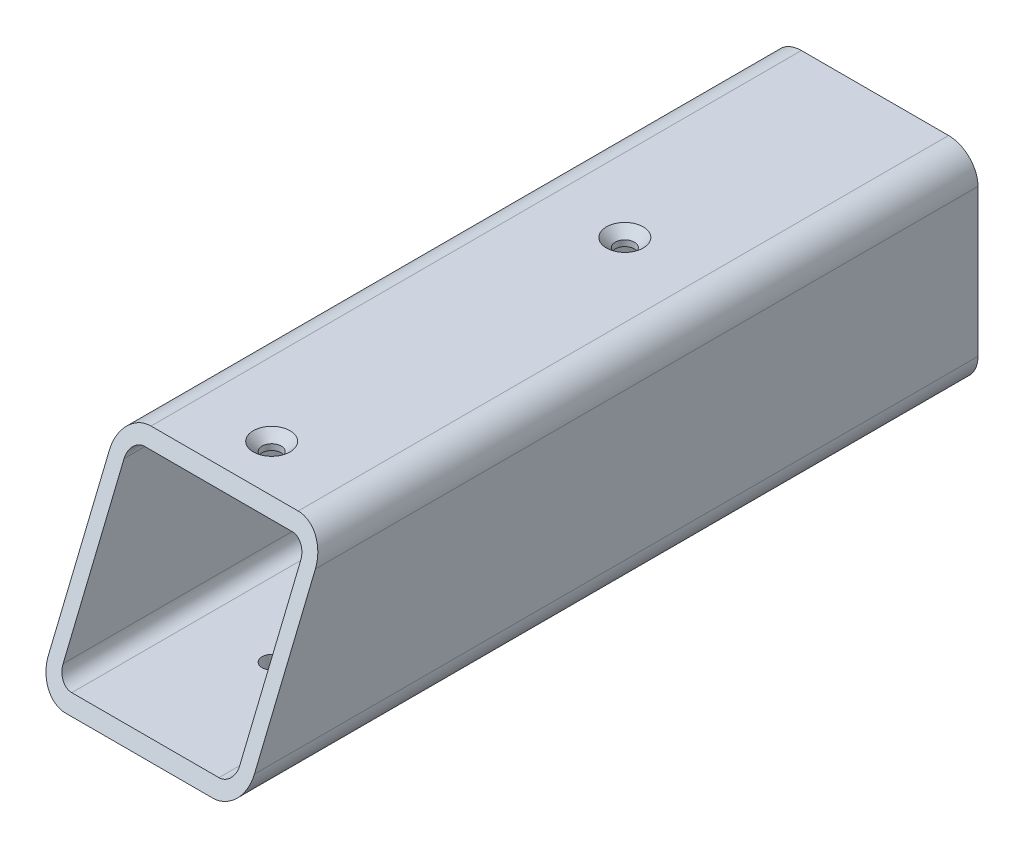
from build123d import *

# Parameters (mm, degrees)
BOSS_EXTRU_1_DEPTH                      = 250
ENL_V_MAT_EXTRU_1_DEPTH                 = 262.963737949
ENL_V_MAT_EXTRU_1_DEPTH_BACK            = 262.963737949
ENL_V_MAT_EXTRU_2_REACH                 = 263.964
ESQUISSE3_R                             = 3.25
CHANFREIN1_SIZE                         = 3
R_P_TITION_LIN_AIRE1_COUNT              = 2
R_P_TITION_LIN_AIRE1_PITCH              = 120
CHANFREIN1_OF_R_P_TITION_LIN_AIRE1_SIZE = 3


with BuildPart() as part:
    # Esquisse1 → Boss.-Extru.1 (new body)
    with BuildSketch(Plane.XY):
        with BuildLine():
            Line((-25, 35), (25, 35))
            ThreePointArc((25, 35), (32.071067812, 32.071067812), (35, 25))
            Line((35, 25), (35, -25))
            ThreePointArc((35, -25), (32.071067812, -32.071067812), (25, -35))
            Line((25, -35), (-25, -35))
            ThreePointArc((-25, -35), (-32.071067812, -32.071067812), (-35, -25))
            Line((-35, -25), (-35, 25))
            ThreePointArc((-35, 25), (-32.071067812, 32.071067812), (-25, 35))
        make_face()
        with BuildLine():
            Line((-25, 30), (25, 30))
            ThreePointArc((25, 30), (28.535533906, 28.535533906), (30, 25))
            Line((30, 25), (30, -25))
            ThreePointArc((30, -25), (28.535533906, -28.535533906), (25, -30))
            Line((25, -30), (-25, -30))
            ThreePointArc((-25, -30), (-28.535533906, -28.535533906), (-30, -25))
            Line((-30, -25), (-30, 25))
            ThreePointArc((-30, 25), (-28.535533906, 28.535533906), (-25, 30))
        make_face(mode=Mode.SUBTRACT)
    extrude(amount=BOSS_EXTRU_1_DEPTH)

    # Esquisse2 → Enl_v. mat.-Extru.1 (cut, two sides: drawn at the far end of the back side and taken through both)
    with BuildSketch(Plane(origin=(35, 0, 0), x_dir=(0, 0, -1), z_dir=(1, 0, 0)).offset(-ENL_V_MAT_EXTRU_1_DEPTH_BACK)):
        Polygon((-250, 639.758196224), (-250, 79.670093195), (-250, -35), (-197.120460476, 92.66250149), (17.215977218, 610.116436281), (140.717470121, 1723.463692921), (-126.498507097, 1753.105452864), align=None)
    extrude(amount=ENL_V_MAT_EXTRU_1_DEPTH + ENL_V_MAT_EXTRU_1_DEPTH_BACK, mode=Mode.SUBTRACT)

    # Enl_v. mat.-Extru.2: up to this face of the body (flat: up to its plane)
    enl_v_mat_extru_2_end = Plane(part.part.faces().sort_by_distance((0, -35, 125))[0])
    # Esquisse3 → Enl_v. mat.-Extru.2 (cut, up to the picked face)
    with BuildSketch(Plane(origin=(0, 35, 0), x_dir=(1, 0, 0), z_dir=(0, 1, 0)), mode=Mode.PRIVATE) as enl_v_mat_extru_2_sk1:
        with Locations(Location((0, -85, 0), (0, 0, 270))):
            Circle(ESQUISSE3_R)
    enl_v_mat_extru_2_tool1 = split(extrude(enl_v_mat_extru_2_sk1.sketch, amount=-ENL_V_MAT_EXTRU_2_REACH, mode=Mode.PRIVATE), bisect_by=enl_v_mat_extru_2_end, keep=Keep.BOTH, mode=Mode.PRIVATE)
    enl_v_mat_extru_2 = enl_v_mat_extru_2_tool1.solids().sort_by(Axis((0, 35, 85), (0, -1, 0)))[0]
    add(enl_v_mat_extru_2, mode=Mode.SUBTRACT)

    # Chanfrein1
    chanfrein1_edges = [part.edges().sort_by_distance(p)[0] for p in [
        (0, 35, 81.75),
    ]]
    chamfer(chanfrein1_edges, length=CHANFREIN1_SIZE)

    # R_p_tition lin_aire1: Enl_v. mat.-Extru.2 ×2
    with Locations(*[(0, 0, i * R_P_TITION_LIN_AIRE1_PITCH) for i in range(1, R_P_TITION_LIN_AIRE1_COUNT)]):
        add(enl_v_mat_extru_2, mode=Mode.SUBTRACT)

    # Chanfrein1 of R_p_tition lin_aire1
    chanfrein1_of_r_p_tition_lin_aire1_edges = [part.edges().sort_by_distance(p)[0] for p in [
        (0, 35, 201.75),
    ]]
    chamfer(chanfrein1_of_r_p_tition_lin_aire1_edges, length=CHANFREIN1_OF_R_P_TITION_LIN_AIRE1_SIZE)


solid = part.part
